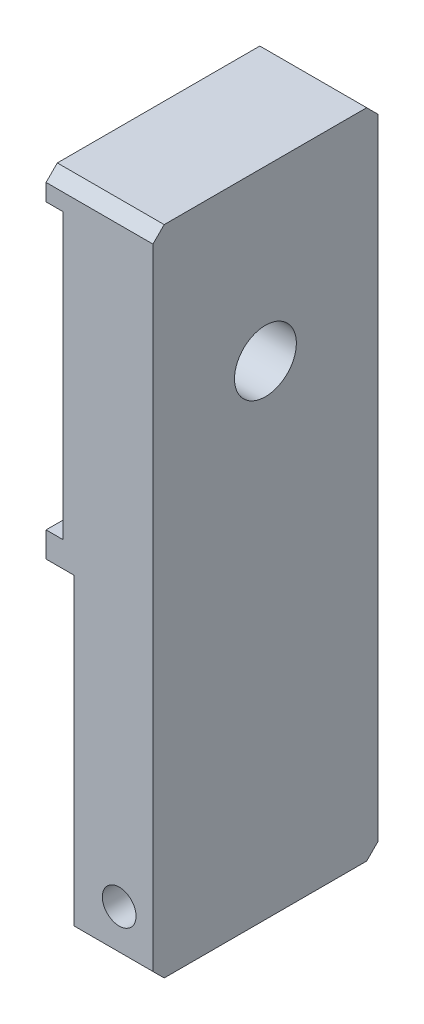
ISO-10303-21;
HEADER;
FILE_DESCRIPTION(('STEP AP214'),'2;1');
FILE_NAME('part.step','',(''),(''),'','','');
FILE_SCHEMA(('AUTOMOTIVE_DESIGN { 1 0 10303 214 1 1 1 1 }'));
ENDSEC;
DATA;
#1=APPLICATION_CONTEXT('core data for automotive mechanical design processes');
#2=APPLICATION_PROTOCOL_DEFINITION('international standard','automotive_design',2000,#1);
#3=PRODUCT_CONTEXT('',#1,'mechanical');
#4=PRODUCT('Part','Part','',(#3));
#5=PRODUCT_RELATED_PRODUCT_CATEGORY('part','',(#4));
#6=PRODUCT_DEFINITION_FORMATION('','',#4);
#7=PRODUCT_DEFINITION_CONTEXT('part definition',#1,'design');
#8=PRODUCT_DEFINITION('design','',#6,#7);
#9=PRODUCT_DEFINITION_SHAPE('','',#8);
#10=(LENGTH_UNIT() NAMED_UNIT(*) SI_UNIT(.MILLI.,.METRE.));
#11=(NAMED_UNIT(*) PLANE_ANGLE_UNIT() SI_UNIT($,.RADIAN.));
#12=(NAMED_UNIT(*) SI_UNIT($,.STERADIAN.) SOLID_ANGLE_UNIT());
#13=UNCERTAINTY_MEASURE_WITH_UNIT(LENGTH_MEASURE(1.E-05),#10,'distance_accuracy_value','');
#14=(GEOMETRIC_REPRESENTATION_CONTEXT(3) GLOBAL_UNCERTAINTY_ASSIGNED_CONTEXT((#13)) GLOBAL_UNIT_ASSIGNED_CONTEXT((#10,
#11,#12)) REPRESENTATION_CONTEXT('',''));
#15=CARTESIAN_POINT('',(0.,0.,0.));
#16=DIRECTION('',(0.,0.,1.));
#17=DIRECTION('',(1.,0.,0.));
#18=AXIS2_PLACEMENT_3D('',#15,#16,#17);
#19=CARTESIAN_POINT('',(14.,0.,20.));
#20=DIRECTION('',(0.,1.,0.));
#21=DIRECTION('',(-1.,0.,0.));
#22=AXIS2_PLACEMENT_3D('',#19,#20,#21);
#23=PLANE('',#22);
#24=DIRECTION('',(0.,0.,-1.));
#25=VECTOR('',#24,1.);
#26=CARTESIAN_POINT('',(0.,0.,20.));
#27=LINE('',#26,#25);
#28=CARTESIAN_POINT('',(0.,0.,18.));
#29=VERTEX_POINT('',#28);
#30=CARTESIAN_POINT('',(0.,0.,-18.));
#31=VERTEX_POINT('',#30);
#32=EDGE_CURVE('E185',#29,#31,#27,.T.);
#33=ORIENTED_EDGE('',*,*,#32,.T.);
#34=DIRECTION('',(1.,0.,0.));
#35=VECTOR('',#34,1.);
#36=CARTESIAN_POINT('',(14.,0.,-18.));
#37=LINE('',#36,#35);
#38=CARTESIAN_POINT('',(14.,0.,-18.));
#39=VERTEX_POINT('',#38);
#40=EDGE_CURVE('E210',#31,#39,#37,.T.);
#41=ORIENTED_EDGE('',*,*,#40,.T.);
#42=DIRECTION('',(0.,0.,-1.));
#43=VECTOR('',#42,1.);
#44=CARTESIAN_POINT('',(14.,0.,20.));
#45=LINE('',#44,#43);
#46=CARTESIAN_POINT('',(14.,0.,18.));
#47=VERTEX_POINT('',#46);
#48=EDGE_CURVE('E205',#47,#39,#45,.T.);
#49=ORIENTED_EDGE('',*,*,#48,.F.);
#50=DIRECTION('',(-1.,0.,0.));
#51=VECTOR('',#50,1.);
#52=CARTESIAN_POINT('',(14.,0.,18.));
#53=LINE('',#52,#51);
#54=EDGE_CURVE('E208',#47,#29,#53,.T.);
#55=ORIENTED_EDGE('',*,*,#54,.T.);
#56=EDGE_LOOP('',(#33,#41,#49,#55));
#57=FACE_BOUND('',#56,.T.);
#58=ADVANCED_FACE('F28',(#57),#23,.F.);
#59=CARTESIAN_POINT('',(14.,116.,20.));
#60=DIRECTION('',(-1.,0.,0.));
#61=DIRECTION('',(0.,-1.,0.));
#62=AXIS2_PLACEMENT_3D('',#59,#60,#61);
#63=PLANE('',#62);
#64=CARTESIAN_POINT('',(14.,86.,0.));
#65=DIRECTION('',(1.,0.,0.));
#66=DIRECTION('',(0.,1.,0.));
#67=AXIS2_PLACEMENT_3D('',#64,#65,#66);
#68=CIRCLE('',#67,5.5);
#69=CARTESIAN_POINT('',(14.,91.5,0.));
#70=VERTEX_POINT('',#69);
#71=EDGE_CURVE('E251',#70,#70,#68,.T.);
#72=ORIENTED_EDGE('',*,*,#71,.F.);
#73=EDGE_LOOP('',(#72));
#74=FACE_BOUND('',#73,.T.);
#75=ORIENTED_EDGE('',*,*,#48,.T.);
#76=DIRECTION('',(0.,0.707106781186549,-0.707106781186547));
#77=VECTOR('',#76,1.);
#78=CARTESIAN_POINT('',(14.,0.,-18.));
#79=LINE('',#78,#77);
#80=CARTESIAN_POINT('',(14.,2.00000000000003,-20.));
#81=VERTEX_POINT('',#80);
#82=EDGE_CURVE('E219',#39,#81,#79,.T.);
#83=ORIENTED_EDGE('',*,*,#82,.T.);
#84=DIRECTION('',(0.,1.,0.));
#85=VECTOR('',#84,1.);
#86=CARTESIAN_POINT('',(14.,116.,-20.));
#87=LINE('',#86,#85);
#88=CARTESIAN_POINT('',(14.,114.,-20.));
#89=VERTEX_POINT('',#88);
#90=EDGE_CURVE('E140',#81,#89,#87,.T.);
#91=ORIENTED_EDGE('',*,*,#90,.T.);
#92=DIRECTION('',(0.,0.70710678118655,0.707106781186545));
#93=VECTOR('',#92,1.);
#94=CARTESIAN_POINT('',(14.,116.,-18.));
#95=LINE('',#94,#93);
#96=CARTESIAN_POINT('',(14.,116.,-18.));
#97=VERTEX_POINT('',#96);
#98=EDGE_CURVE('E217',#89,#97,#95,.T.);
#99=ORIENTED_EDGE('',*,*,#98,.T.);
#100=DIRECTION('',(0.,0.,-1.));
#101=VECTOR('',#100,1.);
#102=CARTESIAN_POINT('',(14.,116.,20.));
#103=LINE('',#102,#101);
#104=CARTESIAN_POINT('',(14.,116.,18.));
#105=VERTEX_POINT('',#104);
#106=EDGE_CURVE('E202',#105,#97,#103,.T.);
#107=ORIENTED_EDGE('',*,*,#106,.F.);
#108=DIRECTION('',(0.,0.707106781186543,-0.707106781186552));
#109=VECTOR('',#108,1.);
#110=CARTESIAN_POINT('',(14.,114.,20.));
#111=LINE('',#110,#109);
#112=CARTESIAN_POINT('',(14.,114.,20.));
#113=VERTEX_POINT('',#112);
#114=EDGE_CURVE('E213',#105,#113,#111,.F.);
#115=ORIENTED_EDGE('',*,*,#114,.T.);
#116=DIRECTION('',(0.,1.,0.));
#117=VECTOR('',#116,1.);
#118=CARTESIAN_POINT('',(14.,116.,20.));
#119=LINE('',#118,#117);
#120=CARTESIAN_POINT('',(14.,2.00000000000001,20.));
#121=VERTEX_POINT('',#120);
#122=EDGE_CURVE('E168',#121,#113,#119,.T.);
#123=ORIENTED_EDGE('',*,*,#122,.F.);
#124=DIRECTION('',(0.,0.707106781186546,0.707106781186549));
#125=VECTOR('',#124,1.);
#126=CARTESIAN_POINT('',(14.,2.,20.));
#127=LINE('',#126,#125);
#128=EDGE_CURVE('E215',#121,#47,#127,.F.);
#129=ORIENTED_EDGE('',*,*,#128,.T.);
#130=EDGE_LOOP('',(#75,#83,#91,#99,#107,#115,#123,#129));
#131=FACE_BOUND('',#130,.T.);
#132=ADVANCED_FACE('F244',(#74,#131),#63,.F.);
#133=CARTESIAN_POINT('',(-5.00000000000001,116.,20.));
#134=DIRECTION('',(0.,-1.,0.));
#135=DIRECTION('',(0.,0.,-1.));
#136=AXIS2_PLACEMENT_3D('',#133,#134,#135);
#137=PLANE('',#136);
#138=ORIENTED_EDGE('',*,*,#106,.T.);
#139=DIRECTION('',(-1.,0.,0.));
#140=VECTOR('',#139,1.);
#141=CARTESIAN_POINT('',(-5.00000000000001,116.,-18.));
#142=LINE('',#141,#140);
#143=CARTESIAN_POINT('',(-5.00000000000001,116.,-18.));
#144=VERTEX_POINT('',#143);
#145=EDGE_CURVE('E231',#97,#144,#142,.T.);
#146=ORIENTED_EDGE('',*,*,#145,.T.);
#147=DIRECTION('',(0.,0.,-1.));
#148=VECTOR('',#147,1.);
#149=CARTESIAN_POINT('',(-5.00000000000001,116.,20.));
#150=LINE('',#149,#148);
#151=CARTESIAN_POINT('',(-5.00000000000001,116.,18.));
#152=VERTEX_POINT('',#151);
#153=EDGE_CURVE('E147',#152,#144,#150,.T.);
#154=ORIENTED_EDGE('',*,*,#153,.F.);
#155=DIRECTION('',(1.,0.,0.));
#156=VECTOR('',#155,1.);
#157=CARTESIAN_POINT('',(-5.00000000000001,116.,18.));
#158=LINE('',#157,#156);
#159=EDGE_CURVE('E229',#152,#105,#158,.T.);
#160=ORIENTED_EDGE('',*,*,#159,.T.);
#161=EDGE_LOOP('',(#138,#146,#154,#160));
#162=FACE_BOUND('',#161,.T.);
#163=ADVANCED_FACE('F240',(#162),#137,.F.);
#164=CARTESIAN_POINT('',(-5.00000000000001,111.,20.));
#165=DIRECTION('',(1.,0.,0.));
#166=DIRECTION('',(0.,0.,-1.));
#167=AXIS2_PLACEMENT_3D('',#164,#165,#166);
#168=PLANE('',#167);
#169=ORIENTED_EDGE('',*,*,#153,.T.);
#170=DIRECTION('',(0.,-0.70710678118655,-0.707106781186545));
#171=VECTOR('',#170,1.);
#172=CARTESIAN_POINT('',(-5.00000000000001,116.,-18.));
#173=LINE('',#172,#171);
#174=CARTESIAN_POINT('',(-5.00000000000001,114.,-20.));
#175=VERTEX_POINT('',#174);
#176=EDGE_CURVE('E50',#144,#175,#173,.T.);
#177=ORIENTED_EDGE('',*,*,#176,.T.);
#178=DIRECTION('',(0.,-1.,0.));
#179=VECTOR('',#178,1.);
#180=CARTESIAN_POINT('',(-5.00000000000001,111.,-20.));
#181=LINE('',#180,#179);
#182=CARTESIAN_POINT('',(-5.00000000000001,111.,-20.));
#183=VERTEX_POINT('',#182);
#184=EDGE_CURVE('E130',#175,#183,#181,.T.);
#185=ORIENTED_EDGE('',*,*,#184,.T.);
#186=DIRECTION('',(0.,0.,-1.));
#187=VECTOR('',#186,1.);
#188=CARTESIAN_POINT('',(-5.00000000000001,111.,20.));
#189=LINE('',#188,#187);
#190=CARTESIAN_POINT('',(-5.00000000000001,111.,20.));
#191=VERTEX_POINT('',#190);
#192=EDGE_CURVE('E135',#191,#183,#189,.T.);
#193=ORIENTED_EDGE('',*,*,#192,.F.);
#194=DIRECTION('',(0.,-1.,0.));
#195=VECTOR('',#194,1.);
#196=CARTESIAN_POINT('',(-5.00000000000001,111.,20.));
#197=LINE('',#196,#195);
#198=CARTESIAN_POINT('',(-5.00000000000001,114.,20.));
#199=VERTEX_POINT('',#198);
#200=EDGE_CURVE('E171',#199,#191,#197,.T.);
#201=ORIENTED_EDGE('',*,*,#200,.F.);
#202=DIRECTION('',(0.,-0.707106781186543,0.707106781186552));
#203=VECTOR('',#202,1.);
#204=CARTESIAN_POINT('',(-5.00000000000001,114.,20.));
#205=LINE('',#204,#203);
#206=EDGE_CURVE('E42',#199,#152,#205,.F.);
#207=ORIENTED_EDGE('',*,*,#206,.T.);
#208=EDGE_LOOP('',(#169,#177,#185,#193,#201,#207));
#209=FACE_BOUND('',#208,.T.);
#210=ADVANCED_FACE('F133',(#209),#168,.F.);
#211=CARTESIAN_POINT('',(-2.00000000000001,111.,20.));
#212=DIRECTION('',(0.,1.,0.));
#213=DIRECTION('',(0.,0.,1.));
#214=AXIS2_PLACEMENT_3D('',#211,#212,#213);
#215=PLANE('',#214);
#216=DIRECTION('',(1.,0.,0.));
#217=VECTOR('',#216,1.);
#218=CARTESIAN_POINT('',(-2.00000000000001,111.,-20.));
#219=LINE('',#218,#217);
#220=CARTESIAN_POINT('',(-2.00000000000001,111.,-20.));
#221=VERTEX_POINT('',#220);
#222=EDGE_CURVE('E139',#183,#221,#219,.T.);
#223=ORIENTED_EDGE('',*,*,#222,.T.);
#224=DIRECTION('',(0.,0.,-1.));
#225=VECTOR('',#224,1.);
#226=CARTESIAN_POINT('',(-2.00000000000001,111.,20.));
#227=LINE('',#226,#225);
#228=CARTESIAN_POINT('',(-2.00000000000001,111.,20.));
#229=VERTEX_POINT('',#228);
#230=EDGE_CURVE('E148',#229,#221,#227,.T.);
#231=ORIENTED_EDGE('',*,*,#230,.F.);
#232=DIRECTION('',(1.,0.,0.));
#233=VECTOR('',#232,1.);
#234=CARTESIAN_POINT('',(-2.00000000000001,111.,20.));
#235=LINE('',#234,#233);
#236=EDGE_CURVE('E146',#191,#229,#235,.T.);
#237=ORIENTED_EDGE('',*,*,#236,.F.);
#238=ORIENTED_EDGE('',*,*,#192,.T.);
#239=EDGE_LOOP('',(#223,#231,#237,#238));
#240=FACE_BOUND('',#239,.T.);
#241=ADVANCED_FACE('F143',(#240),#215,.F.);
#242=CARTESIAN_POINT('',(-2.00000000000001,60.5,20.));
#243=DIRECTION('',(1.,0.,0.));
#244=DIRECTION('',(0.,0.,-1.));
#245=AXIS2_PLACEMENT_3D('',#242,#243,#244);
#246=PLANE('',#245);
#247=CARTESIAN_POINT('',(-2.00000000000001,86.,0.));
#248=DIRECTION('',(1.,0.,0.));
#249=DIRECTION('',(0.,0.,-1.));
#250=AXIS2_PLACEMENT_3D('',#247,#248,#249);
#251=CIRCLE('',#250,5.5);
#252=CARTESIAN_POINT('',(-2.00000000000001,91.5,0.));
#253=VERTEX_POINT('',#252);
#254=EDGE_CURVE('E249',#253,#253,#251,.F.);
#255=ORIENTED_EDGE('',*,*,#254,.F.);
#256=EDGE_LOOP('',(#255));
#257=FACE_BOUND('',#256,.T.);
#258=DIRECTION('',(0.,-1.,0.));
#259=VECTOR('',#258,1.);
#260=CARTESIAN_POINT('',(-2.00000000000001,60.5,-20.));
#261=LINE('',#260,#259);
#262=CARTESIAN_POINT('',(-2.00000000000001,60.5,-20.));
#263=VERTEX_POINT('',#262);
#264=EDGE_CURVE('E154',#221,#263,#261,.T.);
#265=ORIENTED_EDGE('',*,*,#264,.T.);
#266=DIRECTION('',(0.,0.,-1.));
#267=VECTOR('',#266,1.);
#268=CARTESIAN_POINT('',(-2.00000000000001,60.5,20.));
#269=LINE('',#268,#267);
#270=CARTESIAN_POINT('',(-2.00000000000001,60.5,20.));
#271=VERTEX_POINT('',#270);
#272=EDGE_CURVE('E197',#271,#263,#269,.T.);
#273=ORIENTED_EDGE('',*,*,#272,.F.);
#274=DIRECTION('',(0.,-1.,0.));
#275=VECTOR('',#274,1.);
#276=CARTESIAN_POINT('',(-2.00000000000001,60.5,20.));
#277=LINE('',#276,#275);
#278=EDGE_CURVE('E174',#229,#271,#277,.T.);
#279=ORIENTED_EDGE('',*,*,#278,.F.);
#280=ORIENTED_EDGE('',*,*,#230,.T.);
#281=EDGE_LOOP('',(#265,#273,#279,#280));
#282=FACE_BOUND('',#281,.T.);
#283=ADVANCED_FACE('F311',(#257,#282),#246,.F.);
#284=CARTESIAN_POINT('',(-5.00000000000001,60.5,20.));
#285=DIRECTION('',(0.,-1.,0.));
#286=DIRECTION('',(0.,0.,-1.));
#287=AXIS2_PLACEMENT_3D('',#284,#285,#286);
#288=PLANE('',#287);
#289=DIRECTION('',(-1.,0.,0.));
#290=VECTOR('',#289,1.);
#291=CARTESIAN_POINT('',(-5.00000000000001,60.5,-20.));
#292=LINE('',#291,#290);
#293=CARTESIAN_POINT('',(-5.00000000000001,60.5,-20.));
#294=VERTEX_POINT('',#293);
#295=EDGE_CURVE('E156',#263,#294,#292,.T.);
#296=ORIENTED_EDGE('',*,*,#295,.T.);
#297=DIRECTION('',(0.,0.,-1.));
#298=VECTOR('',#297,1.);
#299=CARTESIAN_POINT('',(-5.00000000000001,60.5,20.));
#300=LINE('',#299,#298);
#301=CARTESIAN_POINT('',(-5.00000000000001,60.5,20.));
#302=VERTEX_POINT('',#301);
#303=EDGE_CURVE('E194',#302,#294,#300,.T.);
#304=ORIENTED_EDGE('',*,*,#303,.F.);
#305=DIRECTION('',(-1.,0.,0.));
#306=VECTOR('',#305,1.);
#307=CARTESIAN_POINT('',(-5.00000000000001,60.5,20.));
#308=LINE('',#307,#306);
#309=EDGE_CURVE('E176',#271,#302,#308,.T.);
#310=ORIENTED_EDGE('',*,*,#309,.F.);
#311=ORIENTED_EDGE('',*,*,#272,.T.);
#312=EDGE_LOOP('',(#296,#304,#310,#311));
#313=FACE_BOUND('',#312,.T.);
#314=ADVANCED_FACE('F307',(#313),#288,.F.);
#315=CARTESIAN_POINT('',(-5.00000000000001,56.,20.));
#316=DIRECTION('',(1.,0.,0.));
#317=DIRECTION('',(0.,0.,-1.));
#318=AXIS2_PLACEMENT_3D('',#315,#316,#317);
#319=PLANE('',#318);
#320=DIRECTION('',(0.,-1.,0.));
#321=VECTOR('',#320,1.);
#322=CARTESIAN_POINT('',(-5.00000000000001,56.,-20.));
#323=LINE('',#322,#321);
#324=CARTESIAN_POINT('',(-5.00000000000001,56.,-20.));
#325=VERTEX_POINT('',#324);
#326=EDGE_CURVE('E161',#294,#325,#323,.T.);
#327=ORIENTED_EDGE('',*,*,#326,.T.);
#328=DIRECTION('',(0.,0.,-1.));
#329=VECTOR('',#328,1.);
#330=CARTESIAN_POINT('',(-5.00000000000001,56.,20.));
#331=LINE('',#330,#329);
#332=CARTESIAN_POINT('',(-5.00000000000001,56.,20.));
#333=VERTEX_POINT('',#332);
#334=EDGE_CURVE('E191',#333,#325,#331,.T.);
#335=ORIENTED_EDGE('',*,*,#334,.F.);
#336=DIRECTION('',(0.,-1.,0.));
#337=VECTOR('',#336,1.);
#338=CARTESIAN_POINT('',(-5.00000000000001,56.,20.));
#339=LINE('',#338,#337);
#340=EDGE_CURVE('E178',#302,#333,#339,.T.);
#341=ORIENTED_EDGE('',*,*,#340,.F.);
#342=ORIENTED_EDGE('',*,*,#303,.T.);
#343=EDGE_LOOP('',(#327,#335,#341,#342));
#344=FACE_BOUND('',#343,.T.);
#345=ADVANCED_FACE('F302',(#344),#319,.F.);
#346=CARTESIAN_POINT('',(0.,56.,20.));
#347=DIRECTION('',(0.,1.,0.));
#348=DIRECTION('',(0.,0.,1.));
#349=AXIS2_PLACEMENT_3D('',#346,#347,#348);
#350=PLANE('',#349);
#351=DIRECTION('',(1.,0.,0.));
#352=VECTOR('',#351,1.);
#353=CARTESIAN_POINT('',(0.,56.,-20.));
#354=LINE('',#353,#352);
#355=CARTESIAN_POINT('',(0.,56.,-20.));
#356=VERTEX_POINT('',#355);
#357=EDGE_CURVE('E163',#325,#356,#354,.T.);
#358=ORIENTED_EDGE('',*,*,#357,.T.);
#359=DIRECTION('',(0.,0.,-1.));
#360=VECTOR('',#359,1.);
#361=CARTESIAN_POINT('',(0.,56.,20.));
#362=LINE('',#361,#360);
#363=CARTESIAN_POINT('',(0.,56.,20.));
#364=VERTEX_POINT('',#363);
#365=EDGE_CURVE('E188',#364,#356,#362,.T.);
#366=ORIENTED_EDGE('',*,*,#365,.F.);
#367=DIRECTION('',(1.,0.,0.));
#368=VECTOR('',#367,1.);
#369=CARTESIAN_POINT('',(0.,56.,20.));
#370=LINE('',#369,#368);
#371=EDGE_CURVE('E180',#333,#364,#370,.T.);
#372=ORIENTED_EDGE('',*,*,#371,.F.);
#373=ORIENTED_EDGE('',*,*,#334,.T.);
#374=EDGE_LOOP('',(#358,#366,#372,#373));
#375=FACE_BOUND('',#374,.T.);
#376=ADVANCED_FACE('F275',(#375),#350,.F.);
#377=CARTESIAN_POINT('',(0.,0.,20.));
#378=DIRECTION('',(1.,0.,0.));
#379=DIRECTION('',(0.,0.,-1.));
#380=AXIS2_PLACEMENT_3D('',#377,#378,#379);
#381=PLANE('',#380);
#382=DIRECTION('',(0.,-1.,0.));
#383=VECTOR('',#382,1.);
#384=CARTESIAN_POINT('',(0.,0.,-20.));
#385=LINE('',#384,#383);
#386=CARTESIAN_POINT('',(0.,2.00000000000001,-20.));
#387=VERTEX_POINT('',#386);
#388=EDGE_CURVE('E165',#356,#387,#385,.T.);
#389=ORIENTED_EDGE('',*,*,#388,.T.);
#390=DIRECTION('',(0.,-0.707106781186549,0.707106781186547));
#391=VECTOR('',#390,1.);
#392=CARTESIAN_POINT('',(0.,0.,-18.));
#393=LINE('',#392,#391);
#394=EDGE_CURVE('E227',#387,#31,#393,.T.);
#395=ORIENTED_EDGE('',*,*,#394,.T.);
#396=ORIENTED_EDGE('',*,*,#32,.F.);
#397=DIRECTION('',(0.,-0.707106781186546,-0.707106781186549));
#398=VECTOR('',#397,1.);
#399=CARTESIAN_POINT('',(0.,2.,20.));
#400=LINE('',#399,#398);
#401=CARTESIAN_POINT('',(0.,2.,20.));
#402=VERTEX_POINT('',#401);
#403=EDGE_CURVE('E225',#29,#402,#400,.F.);
#404=ORIENTED_EDGE('',*,*,#403,.T.);
#405=DIRECTION('',(0.,-1.,0.));
#406=VECTOR('',#405,1.);
#407=CARTESIAN_POINT('',(0.,0.,20.));
#408=LINE('',#407,#406);
#409=EDGE_CURVE('E182',#364,#402,#408,.T.);
#410=ORIENTED_EDGE('',*,*,#409,.F.);
#411=ORIENTED_EDGE('',*,*,#365,.T.);
#412=EDGE_LOOP('',(#389,#395,#396,#404,#410,#411));
#413=FACE_BOUND('',#412,.T.);
#414=ADVANCED_FACE('F266',(#413),#381,.F.);
#415=CARTESIAN_POINT('',(0.,0.,20.));
#416=DIRECTION('',(0.,0.,-1.));
#417=DIRECTION('',(-1.,0.,0.));
#418=AXIS2_PLACEMENT_3D('',#415,#416,#417);
#419=PLANE('',#418);
#420=CARTESIAN_POINT('',(8.,9.,20.));
#421=DIRECTION('',(0.,0.,1.));
#422=DIRECTION('',(1.,0.,0.));
#423=AXIS2_PLACEMENT_3D('',#420,#421,#422);
#424=CIRCLE('',#423,3.);
#425=CARTESIAN_POINT('',(11.,9.,20.));
#426=VERTEX_POINT('',#425);
#427=EDGE_CURVE('E256',#426,#426,#424,.T.);
#428=ORIENTED_EDGE('',*,*,#427,.F.);
#429=EDGE_LOOP('',(#428));
#430=FACE_BOUND('',#429,.T.);
#431=ORIENTED_EDGE('',*,*,#409,.T.);
#432=DIRECTION('',(1.,0.,0.));
#433=VECTOR('',#432,1.);
#434=CARTESIAN_POINT('',(0.,2.,20.));
#435=LINE('',#434,#433);
#436=EDGE_CURVE('E11',#402,#121,#435,.T.);
#437=ORIENTED_EDGE('',*,*,#436,.T.);
#438=ORIENTED_EDGE('',*,*,#122,.T.);
#439=DIRECTION('',(-1.,0.,0.));
#440=VECTOR('',#439,1.);
#441=CARTESIAN_POINT('',(0.,114.,20.));
#442=LINE('',#441,#440);
#443=EDGE_CURVE('E35',#113,#199,#442,.T.);
#444=ORIENTED_EDGE('',*,*,#443,.T.);
#445=ORIENTED_EDGE('',*,*,#200,.T.);
#446=ORIENTED_EDGE('',*,*,#236,.T.);
#447=ORIENTED_EDGE('',*,*,#278,.T.);
#448=ORIENTED_EDGE('',*,*,#309,.T.);
#449=ORIENTED_EDGE('',*,*,#340,.T.);
#450=ORIENTED_EDGE('',*,*,#371,.T.);
#451=EDGE_LOOP('',(#431,#437,#438,#444,#445,#446,#447,#448,#449,#450));
#452=FACE_BOUND('',#451,.T.);
#453=ADVANCED_FACE('F235',(#430,#452),#419,.F.);
#454=CARTESIAN_POINT('',(0.,0.,-20.));
#455=DIRECTION('',(0.,0.,-1.));
#456=DIRECTION('',(-1.,0.,0.));
#457=AXIS2_PLACEMENT_3D('',#454,#455,#456);
#458=PLANE('',#457);
#459=CARTESIAN_POINT('',(8.,9.,-20.));
#460=DIRECTION('',(0.,0.,-1.));
#461=DIRECTION('',(-1.,0.,0.));
#462=AXIS2_PLACEMENT_3D('',#459,#460,#461);
#463=CIRCLE('',#462,3.);
#464=CARTESIAN_POINT('',(5.,9.,-20.));
#465=VERTEX_POINT('',#464);
#466=EDGE_CURVE('E257',#465,#465,#463,.F.);
#467=ORIENTED_EDGE('',*,*,#466,.T.);
#468=EDGE_LOOP('',(#467));
#469=FACE_BOUND('',#468,.T.);
#470=ORIENTED_EDGE('',*,*,#90,.F.);
#471=DIRECTION('',(-1.,0.,0.));
#472=VECTOR('',#471,1.);
#473=CARTESIAN_POINT('',(0.,2.00000000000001,-20.));
#474=LINE('',#473,#472);
#475=EDGE_CURVE('E223',#81,#387,#474,.T.);
#476=ORIENTED_EDGE('',*,*,#475,.T.);
#477=ORIENTED_EDGE('',*,*,#388,.F.);
#478=ORIENTED_EDGE('',*,*,#357,.F.);
#479=ORIENTED_EDGE('',*,*,#326,.F.);
#480=ORIENTED_EDGE('',*,*,#295,.F.);
#481=ORIENTED_EDGE('',*,*,#264,.F.);
#482=ORIENTED_EDGE('',*,*,#222,.F.);
#483=ORIENTED_EDGE('',*,*,#184,.F.);
#484=DIRECTION('',(1.,0.,0.));
#485=VECTOR('',#484,1.);
#486=CARTESIAN_POINT('',(14.,114.,-20.));
#487=LINE('',#486,#485);
#488=EDGE_CURVE('E221',#175,#89,#487,.T.);
#489=ORIENTED_EDGE('',*,*,#488,.T.);
#490=EDGE_LOOP('',(#470,#476,#477,#478,#479,#480,#481,#482,#483,#489));
#491=FACE_BOUND('',#490,.T.);
#492=ADVANCED_FACE('F152',(#469,#491),#458,.T.);
#493=CARTESIAN_POINT('',(-5.00100000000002,86.,0.));
#494=DIRECTION('',(1.,0.,0.));
#495=DIRECTION('',(0.,1.,0.));
#496=AXIS2_PLACEMENT_3D('',#493,#494,#495);
#497=CYLINDRICAL_SURFACE('',#496,5.5);
#498=CARTESIAN_POINT('',(14.,91.5,0.));
#499=CARTESIAN_POINT('',(13.8333333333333,91.5,0.));
#500=CARTESIAN_POINT('',(13.6666666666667,91.5,0.));
#501=CARTESIAN_POINT('',(13.3333333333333,91.5,0.));
#502=CARTESIAN_POINT('',(13.1666666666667,91.5,0.));
#503=CARTESIAN_POINT('',(12.8333333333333,91.5,0.));
#504=CARTESIAN_POINT('',(12.6666666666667,91.5,0.));
#505=CARTESIAN_POINT('',(12.3333333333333,91.5,0.));
#506=CARTESIAN_POINT('',(12.1666666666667,91.5,0.));
#507=CARTESIAN_POINT('',(11.8333333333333,91.5,0.));
#508=CARTESIAN_POINT('',(11.6666666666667,91.5,0.));
#509=CARTESIAN_POINT('',(11.3333333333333,91.5,0.));
#510=CARTESIAN_POINT('',(11.1666666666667,91.5,0.));
#511=CARTESIAN_POINT('',(10.8333333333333,91.5,0.));
#512=CARTESIAN_POINT('',(10.6666666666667,91.5,0.));
#513=CARTESIAN_POINT('',(10.3333333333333,91.5,0.));
#514=CARTESIAN_POINT('',(10.1666666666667,91.5,0.));
#515=CARTESIAN_POINT('',(9.83333333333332,91.5,0.));
#516=CARTESIAN_POINT('',(9.66666666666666,91.5,0.));
#517=CARTESIAN_POINT('',(9.33333333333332,91.5,0.));
#518=CARTESIAN_POINT('',(9.16666666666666,91.5,0.));
#519=CARTESIAN_POINT('',(8.83333333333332,91.5,0.));
#520=CARTESIAN_POINT('',(8.66666666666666,91.5,0.));
#521=CARTESIAN_POINT('',(8.33333333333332,91.5,0.));
#522=CARTESIAN_POINT('',(8.16666666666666,91.5,0.));
#523=CARTESIAN_POINT('',(7.83333333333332,91.5,0.));
#524=CARTESIAN_POINT('',(7.66666666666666,91.5,0.));
#525=CARTESIAN_POINT('',(7.33333333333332,91.5,0.));
#526=CARTESIAN_POINT('',(7.16666666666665,91.5,0.));
#527=CARTESIAN_POINT('',(6.83333333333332,91.5,0.));
#528=CARTESIAN_POINT('',(6.66666666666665,91.5,0.));
#529=CARTESIAN_POINT('',(6.33333333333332,91.5,0.));
#530=CARTESIAN_POINT('',(6.16666666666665,91.5,0.));
#531=CARTESIAN_POINT('',(5.83333333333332,91.5,0.));
#532=CARTESIAN_POINT('',(5.66666666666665,91.5,0.));
#533=CARTESIAN_POINT('',(5.33333333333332,91.5,0.));
#534=CARTESIAN_POINT('',(5.16666666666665,91.5,0.));
#535=CARTESIAN_POINT('',(4.83333333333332,91.5,0.));
#536=CARTESIAN_POINT('',(4.66666666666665,91.5,0.));
#537=CARTESIAN_POINT('',(4.33333333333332,91.5,0.));
#538=CARTESIAN_POINT('',(4.16666666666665,91.5,0.));
#539=CARTESIAN_POINT('',(3.83333333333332,91.5,0.));
#540=CARTESIAN_POINT('',(3.66666666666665,91.5,0.));
#541=CARTESIAN_POINT('',(3.33333333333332,91.5,0.));
#542=CARTESIAN_POINT('',(3.16666666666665,91.5,0.));
#543=CARTESIAN_POINT('',(2.83333333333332,91.5,0.));
#544=CARTESIAN_POINT('',(2.66666666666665,91.5,0.));
#545=CARTESIAN_POINT('',(2.33333333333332,91.5,0.));
#546=CARTESIAN_POINT('',(2.16666666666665,91.5,0.));
#547=CARTESIAN_POINT('',(1.83333333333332,91.5,0.));
#548=CARTESIAN_POINT('',(1.66666666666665,91.5,0.));
#549=CARTESIAN_POINT('',(1.33333333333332,91.5,0.));
#550=CARTESIAN_POINT('',(1.16666666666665,91.5,0.));
#551=CARTESIAN_POINT('',(0.833333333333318,91.5,0.));
#552=CARTESIAN_POINT('',(0.666666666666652,91.5,0.));
#553=CARTESIAN_POINT('',(0.333333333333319,91.5,0.));
#554=CARTESIAN_POINT('',(0.166666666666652,91.5,0.));
#555=CARTESIAN_POINT('',(-0.166666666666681,91.5,0.));
#556=CARTESIAN_POINT('',(-0.333333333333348,91.5,0.));
#557=CARTESIAN_POINT('',(-0.666666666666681,91.5,0.));
#558=CARTESIAN_POINT('',(-0.833333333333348,91.5,0.));
#559=CARTESIAN_POINT('',(-1.16666666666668,91.5,0.));
#560=CARTESIAN_POINT('',(-1.33333333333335,91.5,0.));
#561=CARTESIAN_POINT('',(-1.66666666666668,91.5,0.));
#562=CARTESIAN_POINT('',(-1.83333333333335,91.5,0.));
#563=CARTESIAN_POINT('',(-2.00000000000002,91.5,0.));
#564=B_SPLINE_CURVE_WITH_KNOTS('',3,(#498,#499,#500,#501,#502,#503,#504,#505,#506,#507,#508,
#509,#510,#511,#512,#513,#514,#515,#516,#517,#518,#519,#520,#521,#522,#523,#524,#525,#526,#527,
#528,#529,#530,#531,#532,#533,#534,#535,#536,#537,#538,#539,#540,#541,#542,#543,#544,#545,#546,
#547,#548,#549,#550,#551,#552,#553,#554,#555,#556,#557,#558,#559,#560,#561,#562,#563),
.UNSPECIFIED.,.F.,.F.,(4,2,2,2,2,2,2,2,2,2,2,2,2,2,2,2,2,2,2,2,2,2,2,2,2,2,2,2,2,2,2,2,4),(0.,
0.5,1.,1.5,2.,2.5,3.,3.5,4.,4.5,5.,5.5,6.,6.5,7.,7.5,8.,8.5,9.,9.5,10.,10.5,11.,11.5,12.,12.5,
13.,13.5,14.,14.5,15.,15.5,16.),.UNSPECIFIED.);
#565=EDGE_CURVE('BSEAM272',#70,#253,#564,.T.);
#566=ORIENTED_EDGE('',*,*,#71,.T.);
#567=ORIENTED_EDGE('',*,*,#254,.T.);
#568=ORIENTED_EDGE('',*,*,#565,.T.);
#569=ORIENTED_EDGE('',*,*,#565,.F.);
#570=EDGE_LOOP('',(#566,#568,#567,#569));
#571=FACE_BOUND('',#570,.T.);
#572=ADVANCED_FACE('F272',(#571),#497,.F.);
#573=CARTESIAN_POINT('',(8.,9.,-20.001));
#574=DIRECTION('',(0.,0.,1.));
#575=DIRECTION('',(1.,0.,0.));
#576=AXIS2_PLACEMENT_3D('',#573,#574,#575);
#577=CYLINDRICAL_SURFACE('',#576,3.);
#578=ORIENTED_EDGE('',*,*,#466,.F.);
#579=EDGE_LOOP('',(#578));
#580=FACE_BOUND('',#579,.T.);
#581=ORIENTED_EDGE('',*,*,#427,.T.);
#582=EDGE_LOOP('',(#581));
#583=FACE_BOUND('',#582,.T.);
#584=ADVANCED_FACE('F263',(#580,#583),#577,.F.);
#585=CARTESIAN_POINT('',(14.,0.,-18.));
#586=DIRECTION('',(0.,-0.707106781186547,-0.707106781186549));
#587=DIRECTION('',(0.,0.707106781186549,-0.707106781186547));
#588=AXIS2_PLACEMENT_3D('',#585,#586,#587);
#589=PLANE('',#588);
#590=ORIENTED_EDGE('',*,*,#394,.F.);
#591=ORIENTED_EDGE('',*,*,#475,.F.);
#592=ORIENTED_EDGE('',*,*,#82,.F.);
#593=ORIENTED_EDGE('',*,*,#40,.F.);
#594=EDGE_LOOP('',(#590,#591,#592,#593));
#595=FACE_BOUND('',#594,.T.);
#596=ADVANCED_FACE('F292',(#595),#589,.T.);
#597=CARTESIAN_POINT('',(-5.00000000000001,116.,-18.));
#598=DIRECTION('',(0.,0.707106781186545,-0.70710678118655));
#599=DIRECTION('',(0.,0.70710678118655,0.707106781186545));
#600=AXIS2_PLACEMENT_3D('',#597,#598,#599);
#601=PLANE('',#600);
#602=ORIENTED_EDGE('',*,*,#98,.F.);
#603=ORIENTED_EDGE('',*,*,#488,.F.);
#604=ORIENTED_EDGE('',*,*,#176,.F.);
#605=ORIENTED_EDGE('',*,*,#145,.F.);
#606=EDGE_LOOP('',(#602,#603,#604,#605));
#607=FACE_BOUND('',#606,.T.);
#608=ADVANCED_FACE('F247',(#607),#601,.T.);
#609=CARTESIAN_POINT('',(0.,2.,20.));
#610=DIRECTION('',(0.,0.707106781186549,-0.707106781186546));
#611=DIRECTION('',(0.,0.707106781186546,0.707106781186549));
#612=AXIS2_PLACEMENT_3D('',#609,#610,#611);
#613=PLANE('',#612);
#614=ORIENTED_EDGE('',*,*,#403,.F.);
#615=ORIENTED_EDGE('',*,*,#54,.F.);
#616=ORIENTED_EDGE('',*,*,#128,.F.);
#617=ORIENTED_EDGE('',*,*,#436,.F.);
#618=EDGE_LOOP('',(#614,#615,#616,#617));
#619=FACE_BOUND('',#618,.T.);
#620=ADVANCED_FACE('F314',(#619),#613,.F.);
#621=CARTESIAN_POINT('',(0.,114.,20.));
#622=DIRECTION('',(0.,-0.707106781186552,-0.707106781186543));
#623=DIRECTION('',(0.,0.707106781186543,-0.707106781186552));
#624=AXIS2_PLACEMENT_3D('',#621,#622,#623);
#625=PLANE('',#624);
#626=ORIENTED_EDGE('',*,*,#114,.F.);
#627=ORIENTED_EDGE('',*,*,#159,.F.);
#628=ORIENTED_EDGE('',*,*,#206,.F.);
#629=ORIENTED_EDGE('',*,*,#443,.F.);
#630=EDGE_LOOP('',(#626,#627,#628,#629));
#631=FACE_BOUND('',#630,.T.);
#632=ADVANCED_FACE('F242',(#631),#625,.F.);
#633=CLOSED_SHELL('',(#58,#132,#163,#210,#241,#283,#314,#345,#376,#414,#453,#492,#572,#584,#596,
#608,#620,#632));
#634=MANIFOLD_SOLID_BREP('B2',#633);
#635=ADVANCED_BREP_SHAPE_REPRESENTATION('',(#18,#634),#14);
#636=SHAPE_DEFINITION_REPRESENTATION(#9,#635);
ENDSEC;
END-ISO-10303-21;
